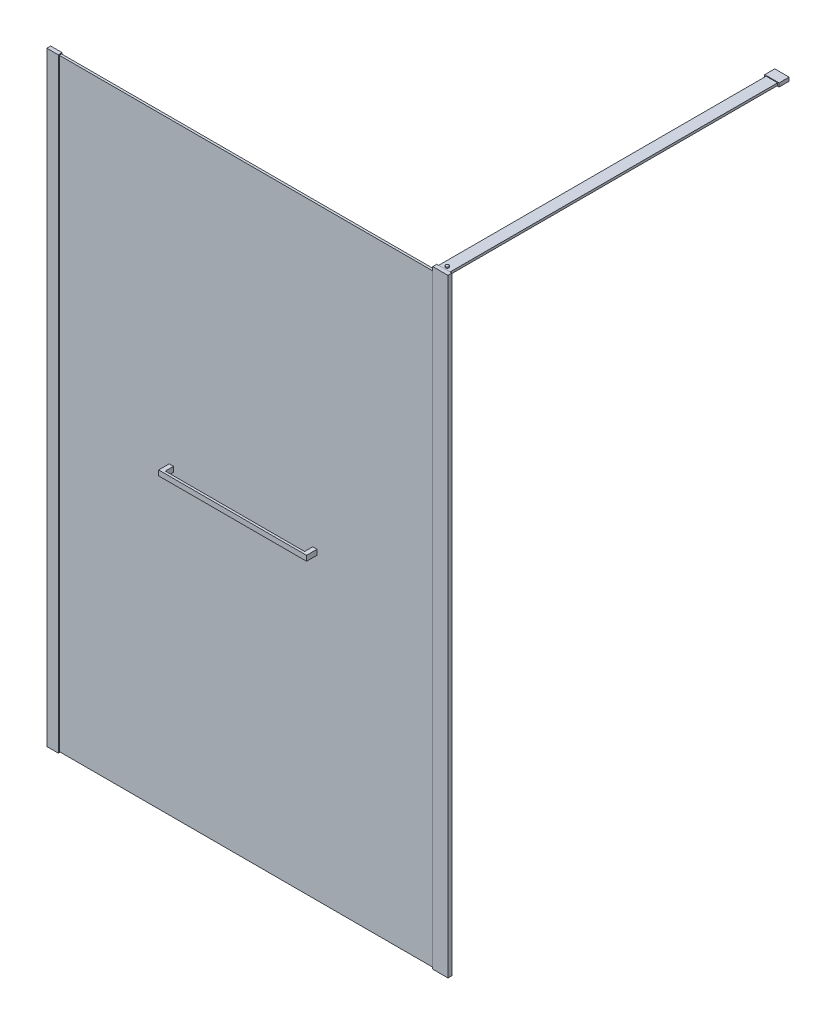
from build123d import *

# Parameters (mm, degrees)
DODANIE_WYCI_GNI_CIE1_START         = 3
DODANIE_WYCI_GNI_CIE1_DEPTH         = 2100
SZKIC2_W                            = 1347
SZKIC2_H                            = 8
DODANIE_WYCI_GNI_CIE2_DEPTH         = 2100
DODANIE_WYCI_GNI_CIE3_DEPTH         = 2108
SZKIC4_W                            = 40
SZKIC4_H                            = 13.3
DODANIE_WYCI_GNI_CIE4_DEPTH         = 3
SZKIC5_W                            = 53
SZKIC5_H                            = 14
DODANIE_WYCI_GNI_CIE5_DEPTH         = 8
DODANIE_WYCI_GNI_CIE6_START         = -1.3
SZKIC6_W                            = 8.1
SZKIC6_H                            = 7.8
DODANIE_WYCI_GNI_CIE6_DEPTH         = 15
SZKIC7_W                            = 53
SZKIC7_H                            = 14
DODANIE_WYCI_GNI_CIE7_DEPTH         = 3
SZKIC8_W                            = 40
SZKIC8_H                            = 13.3
DODANIE_WYCI_GNI_CIE8_DEPTH         = 3
SZKIC9_W                            = 40
SZKIC9_H                            = 8
DODANIE_WYCI_GNI_CIE9_DEPTH         = 1170
DODANIE_WYCI_GNI_CIE10_START        = -29.4
SZKIC10_W                           = 50
SZKIC10_H                           = 12.5
DODANIE_WYCI_GNI_CIE10_DEPTH        = 35
DODANIE_WYCI_GNI_CIE11_DEPTH        = 36.5
DODANIE_WYCI_GNI_CIE11_DEPTH_BACK   = 18
SZKIC12_W                           = 15
SZKIC12_H                           = 18
DODANIE_WYCI_GNI_CIE11_2_DEPTH      = 36.5
DODANIE_WYCI_GNI_CIE11_2_DEPTH_BACK = 18
SZKIC13_W                           = 8
SZKIC13_H                           = 18
DODANIE_WYCI_GNI_CIE12_DEPTH        = 485


with BuildPart() as part:
    # Szkic1 → Dodanie-wyci_gni_cie1 (new body)
    with BuildSketch(Plane(origin=(0, 0, 0), x_dir=(1, 0, 0), z_dir=(0, 1, 0)).offset(DODANIE_WYCI_GNI_CIE1_START)):
        Polygon((0, 0), (0, 13.3), (40, 13.3), (40, 11.4), (6.5, 11.4), (6.5, 3.4), (40, 3.4), (40, 0), align=None)
    extrude(amount=DODANIE_WYCI_GNI_CIE1_DEPTH)

    # Szkic4 → Dodanie-wyci_gni_cie4 (add)
    with BuildSketch(Plane(origin=(0, 2103, 0), x_dir=(1, 0, 0), z_dir=(0, 1, 0))):
        with Locations((20, 6.65)):
            Rectangle(SZKIC4_W, SZKIC4_H)
    extrude(amount=DODANIE_WYCI_GNI_CIE4_DEPTH)

    # Szkic8 → Dodanie-wyci_gni_cie8 (add)
    with BuildSketch(Plane.XZ.offset(-3)):
        with Locations((20, -6.65)):
            Rectangle(SZKIC8_W, SZKIC8_H)
    extrude(amount=DODANIE_WYCI_GNI_CIE8_DEPTH)


with BuildPart() as body_2:
    # Szkic2 → Dodanie-wyci_gni_cie2 (new body)
    with BuildSketch(Plane.XZ.offset(-3)):
        with Locations((680, -7.4)):
            Rectangle(SZKIC2_W, SZKIC2_H)
    extrude(amount=-DODANIE_WYCI_GNI_CIE2_DEPTH)


with BuildPart() as body_3:
    # Szkic3 → Dodanie-wyci_gni_cie3 (new body)
    with BuildSketch(Plane.XZ.offset(-3)):
        Polygon((1343.4, -3.4), (1343.4, -0.4), (1396.4, -0.4), (1396.4, -14.4), (1343.4, -14.4), (1343.4, -11.4), (1353.5, -11.4), (1353.5, -3.4), align=None)
    extrude(amount=-DODANIE_WYCI_GNI_CIE3_DEPTH)

    # Szkic5 → Dodanie-wyci_gni_cie5 (add)
    with BuildSketch(Plane(origin=(0, 2111, 0), x_dir=(1, 0, 0), z_dir=(0, 1, 0))):
        with Locations((1369.9, 7.4)):
            Rectangle(SZKIC5_W, SZKIC5_H)
    extrude(amount=DODANIE_WYCI_GNI_CIE5_DEPTH)

    # Szkic6 → Dodanie-wyci_gni_cie6 (add)
    with BuildSketch(Plane.ZY.offset(-1343.4).offset(DODANIE_WYCI_GNI_CIE6_START)):
        with Locations((-7.4, 2107.1)):
            Rectangle(SZKIC6_W, SZKIC6_H)
    extrude(amount=-DODANIE_WYCI_GNI_CIE6_DEPTH)

    # Szkic7 → Dodanie-wyci_gni_cie7 (add)
    with BuildSketch(Plane.XZ.offset(-3)):
        with Locations((1369.9, -7.4)):
            Rectangle(SZKIC7_W, SZKIC7_H)
    extrude(amount=DODANIE_WYCI_GNI_CIE7_DEPTH)


with BuildPart() as body_4:
    # Szkic9 → Dodanie-wyci_gni_cie9 (new body)
    with BuildSketch(Plane(origin=(0, 0, -14.4), x_dir=(-1, 0, 0), z_dir=(0, 0, -1))):
        with Locations((-1369.9, 2115)):
            Rectangle(SZKIC9_W, SZKIC9_H)
    extrude(amount=DODANIE_WYCI_GNI_CIE9_DEPTH)

    # Szkic10 → Dodanie-wyci_gni_cie10 (add)
    with BuildSketch(Plane(origin=(0, 0, -1184.4), x_dir=(-1, 0, 0), z_dir=(0, 0, -1)).offset(DODANIE_WYCI_GNI_CIE10_START)):
        with Locations((-1369.9, 2115)):
            Rectangle(SZKIC10_W, SZKIC10_H)
    extrude(amount=DODANIE_WYCI_GNI_CIE10_DEPTH)

    # Szkic11 → Obr_t1 (revolve)
    with BuildSketch(Plane(origin=(1369.9, 0, 0), x_dir=(0, 0, -1), z_dir=(1, 0, 0))):
        with BuildLine():
            Line((30.3, 2119), (30.05, 2122.8))
            ThreePointArc((30.05, 2122.8), (27.38045718, 2124.212280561), (24.4, 2124.7))
            Line((24.4, 2124.7), (24.4, 2124.2))
            ThreePointArc((24.4, 2124.2), (27.113886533, 2123.773650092), (29.566308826, 2122.535676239))
            Line((29.566308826, 2122.535676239), (29.798919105, 2119))
            Line((29.798919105, 2119), (30.3, 2119))
        make_face()
    revolve(axis=Axis((1369.9, 2119, -24.4), (0, 1, 0)))


with BuildPart() as body_5:
    # Szkic12 → Dodanie-wyci_gni_cie11 (new, two sides: drawn at the far end of the back side and taken through both)
    with BuildSketch(Plane.XY.offset(-3.4).offset(-DODANIE_WYCI_GNI_CIE11_DEPTH_BACK)):
        with Locations((430, 1053)):
            Rectangle(SZKIC12_W, SZKIC12_H)
    extrude(amount=DODANIE_WYCI_GNI_CIE11_DEPTH + DODANIE_WYCI_GNI_CIE11_DEPTH_BACK)



with BuildPart() as body_6:
    # Szkic12 → Dodanie-wyci_gni_cie11 2 (new, two sides: drawn at the far end of the back side and taken through both)
    with BuildSketch(Plane.XY.offset(-3.4).offset(-DODANIE_WYCI_GNI_CIE11_2_DEPTH_BACK)):
        with Locations((930, 1053)):
            Rectangle(SZKIC12_W, SZKIC12_H)
    extrude(amount=DODANIE_WYCI_GNI_CIE11_2_DEPTH + DODANIE_WYCI_GNI_CIE11_2_DEPTH_BACK)


with BuildPart() as body_5_1:
    add(body_5.part)

    add(body_6.part)  # Dodanie-wyci_gni_cie12 merges body 6
    # Szkic13 → Dodanie-wyci_gni_cie12 (add)
    with BuildSketch(Plane(origin=(437.5, 0, 0), x_dir=(0, 0, -1), z_dir=(1, 0, 0))):
        with Locations((-29.1, 1053)):
            Rectangle(SZKIC13_W, SZKIC13_H)
    extrude(amount=DODANIE_WYCI_GNI_CIE12_DEPTH)


solid = Compound([part.part, body_2.part, body_3.part, body_4.part, body_5_1.part])
